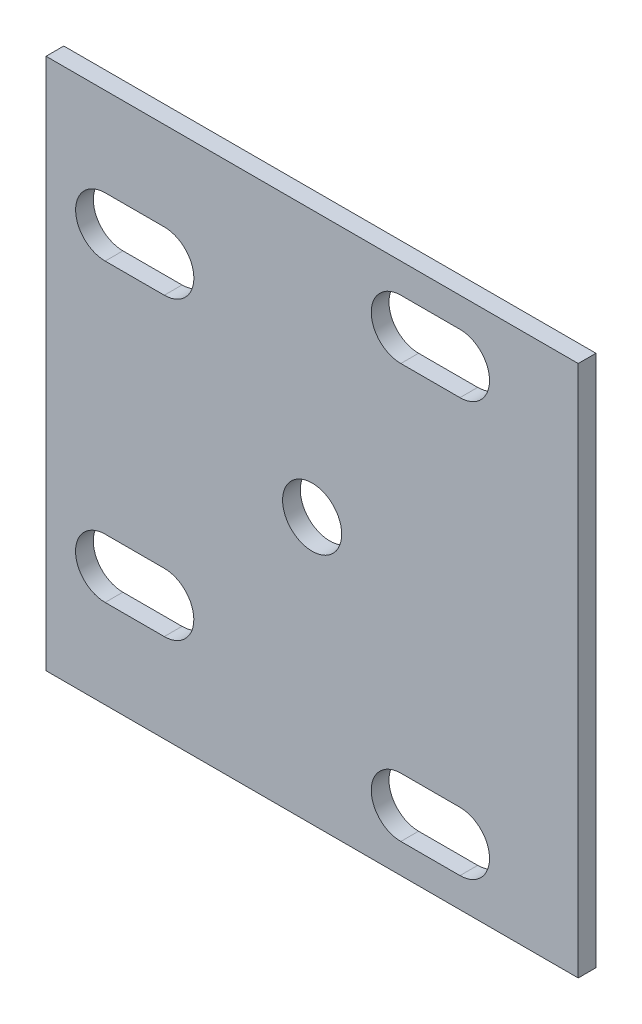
from build123d import *

# Parameters (mm, degrees)
ESQUISSE1_W        = 90
ESQUISSE1_H        = 90
ESQUISSE1_R        = 5
BOSS_EXTRU_1_DEPTH = 3


with BuildPart() as part:
    # Esquisse1 → Boss.-Extru.1 (new body)
    with BuildSketch(Plane.XY):
        with Locations((45, 45)):
            Rectangle(ESQUISSE1_W, ESQUISSE1_H)
        with Locations((45, 45)):
            Circle(ESQUISSE1_R, mode=Mode.SUBTRACT)
        with BuildLine():
            Line((10, 75), (20, 75))
            ThreePointArc((20, 75), (25, 70), (20, 65))
            Line((20, 65), (10, 65))
            ThreePointArc((10, 65), (5, 70), (10, 75))
        make_face(mode=Mode.SUBTRACT)
        with BuildLine():
            Line((9.991151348, 25), (19.991151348, 25))
            ThreePointArc((19.991151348, 25), (24.991151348, 20), (19.991151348, 15))
            Line((19.991151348, 15), (9.991151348, 15))
            ThreePointArc((9.991151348, 15), (4.991151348, 20), (9.991151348, 25))
        make_face(mode=Mode.SUBTRACT)
        with BuildLine():
            Line((70, 85), (60, 85))
            ThreePointArc((60, 85), (55, 80), (60, 75))
            Line((60, 75), (70, 75))
            ThreePointArc((70, 75), (75, 80), (70, 85))
        make_face(mode=Mode.SUBTRACT)
        with BuildLine():
            Line((60, 15), (70, 15))
            ThreePointArc((70, 15), (75, 10), (70, 5))
            Line((70, 5), (60, 5))
            ThreePointArc((60, 5), (55, 10), (60, 15))
        make_face(mode=Mode.SUBTRACT)
    extrude(amount=BOSS_EXTRU_1_DEPTH)


solid = part.part
